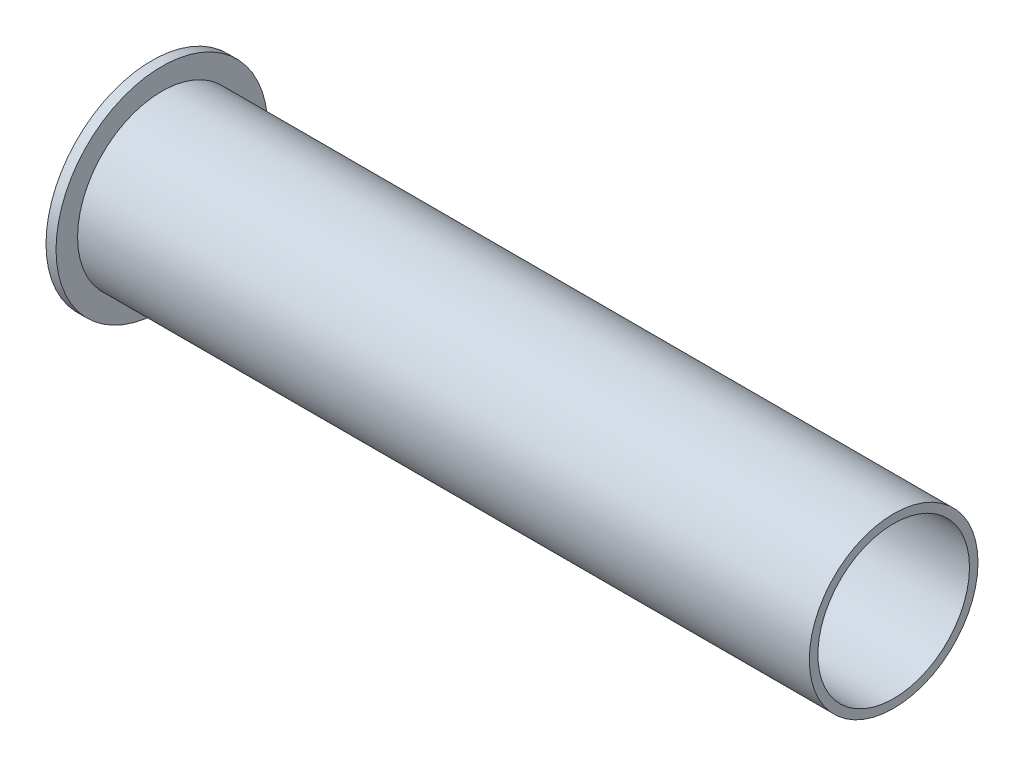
from build123d import *

# Parameters (mm, degrees)
SKETCH1_R           = 6.4135
SKETCH1_R_2         = 5.7658
BOSS_EXTRUDE1_DEPTH = 56.4134
SKETCH2_R           = 8.0518
SKETCH2_R_2         = 5.7658
BOSS_EXTRUDE2_DEPTH = 0.762


with BuildPart() as part:
    # Sketch1 → Boss-Extrude1 (new body)
    with BuildSketch(Plane(origin=(0, 0, 0), x_dir=(0, 0, -1), z_dir=(1, 0, 0))):
        Circle(SKETCH1_R)
        Circle(SKETCH1_R_2, mode=Mode.SUBTRACT)
    extrude(amount=BOSS_EXTRUDE1_DEPTH)

    # Sketch2 → Boss-Extrude2 (add)
    with BuildSketch(Plane.ZY):
        Circle(SKETCH2_R)
        with Locations(Location((0, 0, 0), (0, 0, 180))):
            Circle(SKETCH2_R_2, mode=Mode.SUBTRACT)
    extrude(amount=-BOSS_EXTRUDE2_DEPTH)


solid = part.part
